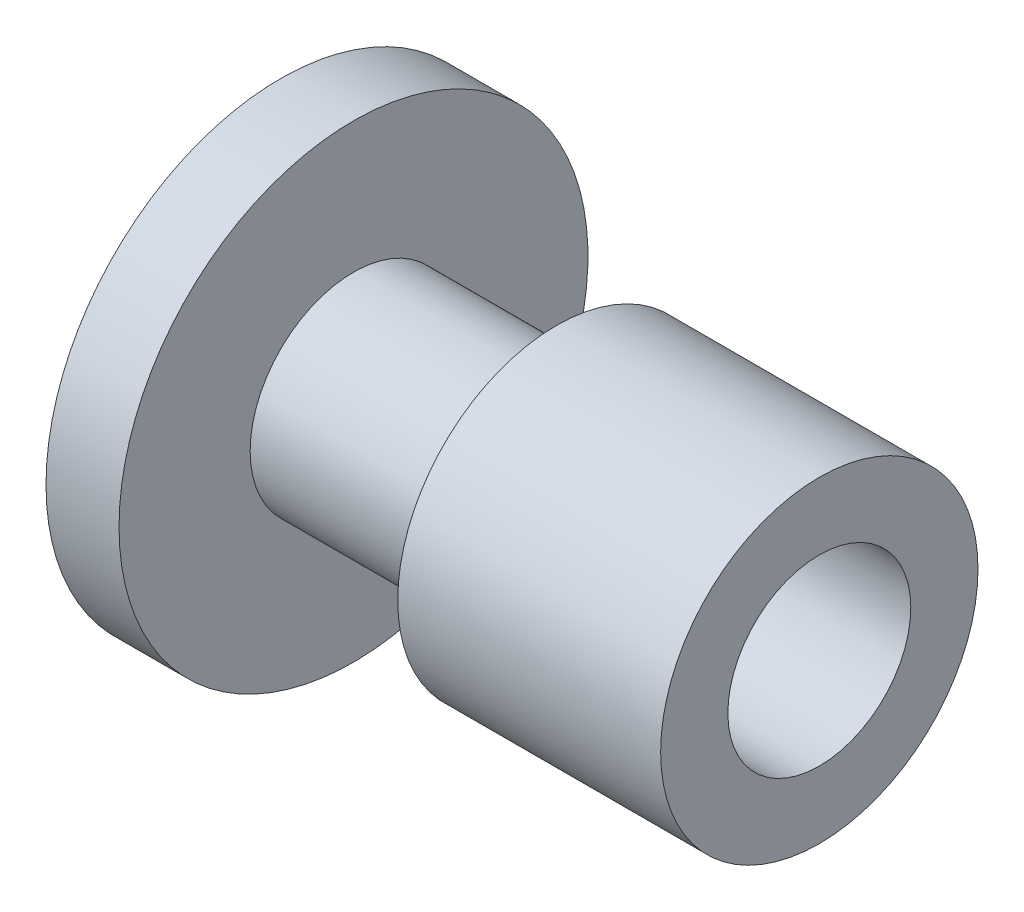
from build123d import *


with BuildPart() as part:
    # Sketch1 → Revolve1 (revolve)
    with BuildSketch(Plane.XY, mode=Mode.PRIVATE) as revolve1_sk:
        Polygon((0, 0), (0, 30.352975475), (9.453412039, 30.352975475), (9.453412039, 13.37863272), (35.721009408, 13.37863272), (35.721009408, 20.540657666), (69.756068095, 20.540657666), (69.756068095, 11.841727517), (46.123584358, 11.841727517), (46.123584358, 5.732269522), (7.547489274, 5.732269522), (7.547489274, 0), align=None)
    revolve(revolve1_sk.sketch.rotate(Axis((0, 0, 0), (1, 0, 0)), 90), axis=Axis((0, 0, 0), (1, 0, 0)))


solid = part.part
